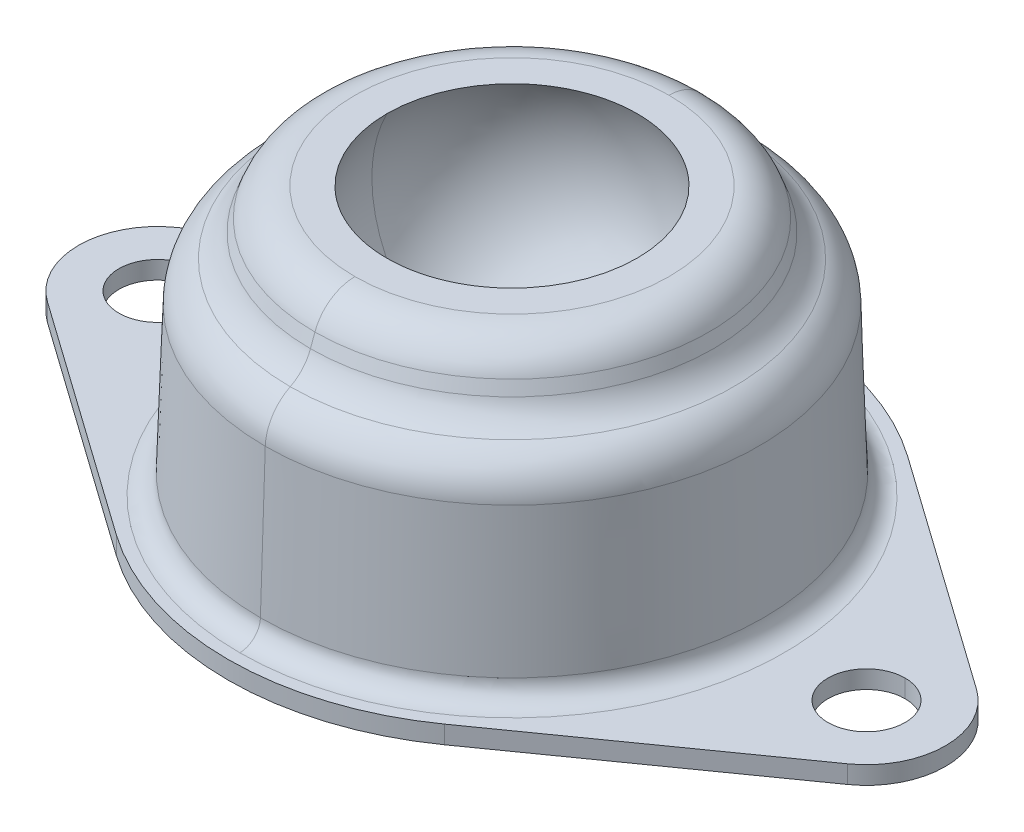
ISO-10303-21;
HEADER;
FILE_DESCRIPTION(('STEP AP214'),'2;1');
FILE_NAME('part.step','',(''),(''),'','','');
FILE_SCHEMA(('AUTOMOTIVE_DESIGN { 1 0 10303 214 1 1 1 1 }'));
ENDSEC;
DATA;
#1=APPLICATION_CONTEXT('core data for automotive mechanical design processes');
#2=APPLICATION_PROTOCOL_DEFINITION('international standard','automotive_design',2000,#1);
#3=PRODUCT_CONTEXT('',#1,'mechanical');
#4=PRODUCT('Part','Part','',(#3));
#5=PRODUCT_RELATED_PRODUCT_CATEGORY('part','',(#4));
#6=PRODUCT_DEFINITION_FORMATION('','',#4);
#7=PRODUCT_DEFINITION_CONTEXT('part definition',#1,'design');
#8=PRODUCT_DEFINITION('design','',#6,#7);
#9=PRODUCT_DEFINITION_SHAPE('','',#8);
#10=(LENGTH_UNIT() NAMED_UNIT(*) SI_UNIT(.MILLI.,.METRE.));
#11=(NAMED_UNIT(*) PLANE_ANGLE_UNIT() SI_UNIT($,.RADIAN.));
#12=(NAMED_UNIT(*) SI_UNIT($,.STERADIAN.) SOLID_ANGLE_UNIT());
#13=UNCERTAINTY_MEASURE_WITH_UNIT(LENGTH_MEASURE(1.E-05),#10,'distance_accuracy_value','');
#14=(GEOMETRIC_REPRESENTATION_CONTEXT(3) GLOBAL_UNCERTAINTY_ASSIGNED_CONTEXT((#13)) GLOBAL_UNIT_ASSIGNED_CONTEXT((#10,
#11,#12)) REPRESENTATION_CONTEXT('',''));
#15=CARTESIAN_POINT('',(0.,0.,0.));
#16=DIRECTION('',(0.,0.,1.));
#17=DIRECTION('',(1.,0.,0.));
#18=AXIS2_PLACEMENT_3D('',#15,#16,#17);
#19=CARTESIAN_POINT('',(0.,12.6365,0.));
#20=DIRECTION('',(0.,0.,-1.));
#21=DIRECTION('',(-1.,0.,0.));
#22=AXIS2_PLACEMENT_3D('',#19,#20,#21);
#23=SPHERICAL_SURFACE('',#22,7.9375);
#24=CARTESIAN_POINT('',(0.,12.6365,0.));
#25=DIRECTION('',(0.,0.,-1.));
#26=DIRECTION('',(-1.,0.,0.));
#27=AXIS2_PLACEMENT_3D('',#24,#25,#26);
#28=CIRCLE('',#27,7.9375);
#29=CARTESIAN_POINT('',(7.09001315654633,16.2052,0.));
#30=VERTEX_POINT('',#29);
#31=CARTESIAN_POINT('',(0.,4.699,0.));
#32=VERTEX_POINT('',#31);
#33=EDGE_CURVE('E439',#30,#32,#28,.T.);
#34=ORIENTED_EDGE('',*,*,#33,.F.);
#35=CARTESIAN_POINT('',(0.,16.2052,0.));
#36=DIRECTION('',(0.,-1.,0.));
#37=DIRECTION('',(0.,0.,-1.));
#38=AXIS2_PLACEMENT_3D('',#35,#36,#37);
#39=CIRCLE('',#38,7.09001315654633);
#40=CARTESIAN_POINT('',(-7.09001315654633,16.2052,0.));
#41=VERTEX_POINT('',#40);
#42=EDGE_CURVE('E304',#41,#30,#39,.T.);
#43=ORIENTED_EDGE('',*,*,#42,.F.);
#44=CARTESIAN_POINT('',(0.,12.6365,0.));
#45=DIRECTION('',(0.,0.,1.));
#46=DIRECTION('',(1.,0.,0.));
#47=AXIS2_PLACEMENT_3D('',#44,#45,#46);
#48=CIRCLE('',#47,7.9375);
#49=EDGE_CURVE('E378',#41,#32,#48,.T.);
#50=ORIENTED_EDGE('',*,*,#49,.T.);
#51=EDGE_LOOP('',(#34,#43,#50));
#52=FACE_BOUND('',#51,.T.);
#53=ADVANCED_FACE('F16',(#52),#23,.F.);
#54=CARTESIAN_POINT('',(0.,12.6365,0.));
#55=DIRECTION('',(0.,0.,-1.));
#56=DIRECTION('',(1.,0.,0.));
#57=AXIS2_PLACEMENT_3D('',#54,#55,#56);
#58=SPHERICAL_SURFACE('',#57,10.7061);
#59=CARTESIAN_POINT('',(0.,12.6365,0.));
#60=DIRECTION('',(0.,0.,-1.));
#61=DIRECTION('',(-1.,0.,0.));
#62=AXIS2_PLACEMENT_3D('',#59,#60,#61);
#63=CIRCLE('',#62,10.7061);
#64=CARTESIAN_POINT('',(0.,1.9304,0.));
#65=VERTEX_POINT('',#64);
#66=CARTESIAN_POINT('',(-10.4564121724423,10.3378,0.));
#67=VERTEX_POINT('',#66);
#68=EDGE_CURVE('E343',#65,#67,#63,.T.);
#69=ORIENTED_EDGE('',*,*,#68,.F.);
#70=CARTESIAN_POINT('',(0.,12.6365,0.));
#71=DIRECTION('',(0.,0.,1.));
#72=DIRECTION('',(1.,0.,0.));
#73=AXIS2_PLACEMENT_3D('',#70,#71,#72);
#74=CIRCLE('',#73,10.7061);
#75=CARTESIAN_POINT('',(10.4564121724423,10.3378,0.));
#76=VERTEX_POINT('',#75);
#77=EDGE_CURVE('E659',#65,#76,#74,.T.);
#78=ORIENTED_EDGE('',*,*,#77,.T.);
#79=CARTESIAN_POINT('',(0.,10.3378,0.));
#80=DIRECTION('',(0.,1.,0.));
#81=DIRECTION('',(0.,0.,1.));
#82=AXIS2_PLACEMENT_3D('',#79,#80,#81);
#83=CIRCLE('',#82,10.4564121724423);
#84=EDGE_CURVE('E11',#67,#76,#83,.T.);
#85=ORIENTED_EDGE('',*,*,#84,.F.);
#86=EDGE_LOOP('',(#69,#78,#85));
#87=FACE_BOUND('',#86,.T.);
#88=ADVANCED_FACE('F690',(#87),#58,.T.);
#89=CARTESIAN_POINT('',(0.,10.3378,0.));
#90=DIRECTION('',(0.,1.,0.));
#91=DIRECTION('',(1.,0.,0.));
#92=AXIS2_PLACEMENT_3D('',#89,#90,#91);
#93=PLANE('',#92);
#94=CARTESIAN_POINT('',(0.,10.3378,0.));
#95=DIRECTION('',(0.,1.,0.));
#96=DIRECTION('',(0.,0.,1.));
#97=AXIS2_PLACEMENT_3D('',#94,#95,#96);
#98=CIRCLE('',#97,10.4564121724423);
#99=EDGE_CURVE('E425',#76,#67,#98,.T.);
#100=ORIENTED_EDGE('',*,*,#99,.T.);
#101=ORIENTED_EDGE('',*,*,#84,.T.);
#102=EDGE_LOOP('',(#100,#101));
#103=FACE_BOUND('',#102,.T.);
#104=CARTESIAN_POINT('',(0.,10.3378,0.));
#105=DIRECTION('',(0.,1.,0.));
#106=DIRECTION('',(0.,0.,1.));
#107=AXIS2_PLACEMENT_3D('',#104,#105,#106);
#108=CIRCLE('',#107,12.2809);
#109=CARTESIAN_POINT('',(0.,10.3378,-12.2809));
#110=VERTEX_POINT('',#109);
#111=CARTESIAN_POINT('',(0.,10.3378,12.2809));
#112=VERTEX_POINT('',#111);
#113=EDGE_CURVE('E300',#110,#112,#108,.T.);
#114=ORIENTED_EDGE('',*,*,#113,.F.);
#115=CARTESIAN_POINT('',(0.,10.3378,0.));
#116=DIRECTION('',(0.,1.,0.));
#117=DIRECTION('',(0.,0.,1.));
#118=AXIS2_PLACEMENT_3D('',#115,#116,#117);
#119=CIRCLE('',#118,12.2809);
#120=EDGE_CURVE('E27',#112,#110,#119,.T.);
#121=ORIENTED_EDGE('',*,*,#120,.F.);
#122=EDGE_LOOP('',(#114,#121));
#123=FACE_BOUND('',#122,.T.);
#124=ADVANCED_FACE('F696',(#103,#123),#93,.F.);
#125=CARTESIAN_POINT('',(0.,10.3378,0.));
#126=DIRECTION('',(0.,-1.,0.));
#127=DIRECTION('',(0.,0.,-1.));
#128=AXIS2_PLACEMENT_3D('',#125,#126,#127);
#129=CONICAL_SURFACE('',#128,12.2809,0.033161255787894);
#130=DIRECTION('',(0.,-0.999450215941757,0.0331551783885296));
#131=VECTOR('',#130,1.);
#132=CARTESIAN_POINT('',(0.,10.3378,12.2809));
#133=LINE('',#132,#131);
#134=CARTESIAN_POINT('',(0.,1.09822428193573,12.5874082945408));
#135=VERTEX_POINT('',#134);
#136=EDGE_CURVE('E292',#112,#135,#133,.T.);
#137=ORIENTED_EDGE('',*,*,#136,.F.);
#138=ORIENTED_EDGE('',*,*,#120,.T.);
#139=DIRECTION('',(0.,-0.999450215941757,-0.0331551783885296));
#140=VECTOR('',#139,1.);
#141=CARTESIAN_POINT('',(0.,10.3378,-12.2809));
#142=LINE('',#141,#140);
#143=CARTESIAN_POINT('',(0.,1.09822428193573,-12.5874082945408));
#144=VERTEX_POINT('',#143);
#145=EDGE_CURVE('E283',#110,#144,#142,.T.);
#146=ORIENTED_EDGE('',*,*,#145,.T.);
#147=CARTESIAN_POINT('',(0.,1.09822428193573,0.));
#148=DIRECTION('',(0.,1.,0.));
#149=DIRECTION('',(0.,0.,1.));
#150=AXIS2_PLACEMENT_3D('',#147,#148,#149);
#151=CIRCLE('',#150,12.5874082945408);
#152=EDGE_CURVE('E277',#135,#144,#151,.T.);
#153=ORIENTED_EDGE('',*,*,#152,.F.);
#154=EDGE_LOOP('',(#137,#138,#146,#153));
#155=FACE_BOUND('',#154,.T.);
#156=ADVANCED_FACE('F285',(#155),#129,.F.);
#157=CARTESIAN_POINT('',(0.,1.1358847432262,0.));
#158=DIRECTION('',(0.,1.,0.));
#159=DIRECTION('',(0.,0.,1.));
#160=AXIS2_PLACEMENT_3D('',#157,#158,#159);
#161=TOROIDAL_SURFACE('',#160,13.7226685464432,1.1358847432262);
#162=CARTESIAN_POINT('',(0.,1.1358847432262,-13.7226685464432));
#163=DIRECTION('',(1.,0.,0.));
#164=DIRECTION('',(0.,0.,-1.));
#165=AXIS2_PLACEMENT_3D('',#162,#163,#164);
#166=CIRCLE('',#165,1.1358847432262);
#167=CARTESIAN_POINT('',(0.,0.,-13.7226685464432));
#168=VERTEX_POINT('',#167);
#169=EDGE_CURVE('E264',#144,#168,#166,.T.);
#170=ORIENTED_EDGE('',*,*,#169,.F.);
#171=CARTESIAN_POINT('',(0.,1.09822428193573,0.));
#172=DIRECTION('',(0.,1.,0.));
#173=DIRECTION('',(0.,0.,1.));
#174=AXIS2_PLACEMENT_3D('',#171,#172,#173);
#175=CIRCLE('',#174,12.5874082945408);
#176=EDGE_CURVE('E269',#144,#135,#175,.T.);
#177=ORIENTED_EDGE('',*,*,#176,.T.);
#178=CARTESIAN_POINT('',(0.,1.1358847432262,13.7226685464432));
#179=DIRECTION('',(-1.,0.,0.));
#180=DIRECTION('',(0.,0.,1.));
#181=AXIS2_PLACEMENT_3D('',#178,#179,#180);
#182=CIRCLE('',#181,1.1358847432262);
#183=CARTESIAN_POINT('',(0.,0.,13.7226685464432));
#184=VERTEX_POINT('',#183);
#185=EDGE_CURVE('E281',#135,#184,#182,.T.);
#186=ORIENTED_EDGE('',*,*,#185,.T.);
#187=CARTESIAN_POINT('',(0.,0.,0.));
#188=DIRECTION('',(0.,1.,0.));
#189=DIRECTION('',(0.,0.,1.));
#190=AXIS2_PLACEMENT_3D('',#187,#188,#189);
#191=CIRCLE('',#190,13.7226685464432);
#192=EDGE_CURVE('E271',#168,#184,#191,.T.);
#193=ORIENTED_EDGE('',*,*,#192,.F.);
#194=EDGE_LOOP('',(#170,#177,#186,#193));
#195=FACE_BOUND('',#194,.T.);
#196=ADVANCED_FACE('F266',(#195),#161,.T.);
#197=CARTESIAN_POINT('',(0.,2.14781962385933,0.));
#198=DIRECTION('',(0.,-1.,0.));
#199=DIRECTION('',(0.,0.,-1.));
#200=AXIS2_PLACEMENT_3D('',#197,#198,#199);
#201=CONICAL_SURFACE('',#200,14.2494,0.033161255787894);
#202=DIRECTION('',(0.,-0.999450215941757,0.0331551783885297));
#203=VECTOR('',#202,1.);
#204=CARTESIAN_POINT('',(0.,2.14781962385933,14.2494));
#205=LINE('',#204,#203);
#206=CARTESIAN_POINT('',(0.,10.4223601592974,13.9749052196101));
#207=VERTEX_POINT('',#206);
#208=CARTESIAN_POINT('',(0.,2.14781962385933,14.2494));
#209=VERTEX_POINT('',#208);
#210=EDGE_CURVE('E315',#207,#209,#205,.T.);
#211=ORIENTED_EDGE('',*,*,#210,.F.);
#212=CARTESIAN_POINT('',(0.,10.4223601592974,0.));
#213=DIRECTION('',(0.,1.,0.));
#214=DIRECTION('',(0.,0.,1.));
#215=AXIS2_PLACEMENT_3D('',#212,#213,#214);
#216=CIRCLE('',#215,13.9749052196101);
#217=CARTESIAN_POINT('',(0.,10.4223601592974,-13.9749052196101));
#218=VERTEX_POINT('',#217);
#219=EDGE_CURVE('E393',#218,#207,#216,.T.);
#220=ORIENTED_EDGE('',*,*,#219,.F.);
#221=DIRECTION('',(0.,-0.999450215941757,-0.0331551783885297));
#222=VECTOR('',#221,1.);
#223=CARTESIAN_POINT('',(0.,2.14781962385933,-14.2494));
#224=LINE('',#223,#222);
#225=CARTESIAN_POINT('',(0.,2.14781962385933,-14.2494));
#226=VERTEX_POINT('',#225);
#227=EDGE_CURVE('E314',#218,#226,#224,.T.);
#228=ORIENTED_EDGE('',*,*,#227,.T.);
#229=CARTESIAN_POINT('',(0.,2.14781962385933,0.));
#230=DIRECTION('',(0.,1.,0.));
#231=DIRECTION('',(0.,0.,1.));
#232=AXIS2_PLACEMENT_3D('',#229,#230,#231);
#233=CIRCLE('',#232,14.2494);
#234=EDGE_CURVE('E487',#226,#209,#233,.T.);
#235=ORIENTED_EDGE('',*,*,#234,.T.);
#236=EDGE_LOOP('',(#211,#220,#228,#235));
#237=FACE_BOUND('',#236,.T.);
#238=ADVANCED_FACE('F597',(#237),#201,.T.);
#239=CARTESIAN_POINT('',(0.,10.3369326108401,0.));
#240=DIRECTION('',(0.,1.,0.));
#241=DIRECTION('',(0.,0.,1.));
#242=AXIS2_PLACEMENT_3D('',#239,#240,#241);
#243=TOROIDAL_SURFACE('',#242,11.3997243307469,2.57659746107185);
#244=CARTESIAN_POINT('',(0.,10.3369326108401,-11.3997243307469));
#245=DIRECTION('',(1.,0.,0.));
#246=DIRECTION('',(0.,0.,-1.));
#247=AXIS2_PLACEMENT_3D('',#244,#245,#246);
#248=CIRCLE('',#247,2.57659746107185);
#249=CARTESIAN_POINT('',(0.,12.6365,-12.5619826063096));
#250=VERTEX_POINT('',#249);
#251=EDGE_CURVE('E450',#218,#250,#248,.T.);
#252=ORIENTED_EDGE('',*,*,#251,.F.);
#253=ORIENTED_EDGE('',*,*,#219,.T.);
#254=CARTESIAN_POINT('',(0.,10.3369326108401,11.3997243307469));
#255=DIRECTION('',(-1.,0.,0.));
#256=DIRECTION('',(0.,0.,1.));
#257=AXIS2_PLACEMENT_3D('',#254,#255,#256);
#258=CIRCLE('',#257,2.57659746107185);
#259=CARTESIAN_POINT('',(0.,12.6365,12.5619826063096));
#260=VERTEX_POINT('',#259);
#261=EDGE_CURVE('E320',#207,#260,#258,.T.);
#262=ORIENTED_EDGE('',*,*,#261,.T.);
#263=CARTESIAN_POINT('',(0.,12.6365,0.));
#264=DIRECTION('',(0.,1.,0.));
#265=DIRECTION('',(0.,0.,1.));
#266=AXIS2_PLACEMENT_3D('',#263,#264,#265);
#267=CIRCLE('',#266,12.5619826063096);
#268=EDGE_CURVE('E431',#250,#260,#267,.T.);
#269=ORIENTED_EDGE('',*,*,#268,.F.);
#270=EDGE_LOOP('',(#252,#253,#262,#269));
#271=FACE_BOUND('',#270,.T.);
#272=ADVANCED_FACE('F596',(#271),#243,.T.);
#273=CARTESIAN_POINT('',(0.,14.7309938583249,0.));
#274=DIRECTION('',(0.,1.,0.));
#275=DIRECTION('',(0.,0.,1.));
#276=AXIS2_PLACEMENT_3D('',#273,#274,#275);
#277=TOROIDAL_SURFACE('',#276,13.6205916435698,2.34681861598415);
#278=CARTESIAN_POINT('',(0.,14.7309938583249,-13.6205916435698));
#279=DIRECTION('',(1.,0.,0.));
#280=DIRECTION('',(0.,0.,-1.));
#281=AXIS2_PLACEMENT_3D('',#278,#279,#280);
#282=CIRCLE('',#281,2.34681861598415);
#283=CARTESIAN_POINT('',(0.,13.9273469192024,-11.4156632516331));
#284=VERTEX_POINT('',#283);
#285=EDGE_CURVE('E319',#284,#250,#282,.T.);
#286=ORIENTED_EDGE('',*,*,#285,.F.);
#287=CARTESIAN_POINT('',(0.,13.9273469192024,0.));
#288=DIRECTION('',(0.,1.,0.));
#289=DIRECTION('',(0.,0.,1.));
#290=AXIS2_PLACEMENT_3D('',#287,#288,#289);
#291=CIRCLE('',#290,11.4156632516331);
#292=CARTESIAN_POINT('',(0.,13.9273469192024,11.4156632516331));
#293=VERTEX_POINT('',#292);
#294=EDGE_CURVE('E394',#293,#284,#291,.T.);
#295=ORIENTED_EDGE('',*,*,#294,.F.);
#296=CARTESIAN_POINT('',(0.,14.7309938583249,13.6205916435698));
#297=DIRECTION('',(-1.,0.,0.));
#298=DIRECTION('',(0.,0.,1.));
#299=AXIS2_PLACEMENT_3D('',#296,#297,#298);
#300=CIRCLE('',#299,2.34681861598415);
#301=EDGE_CURVE('E435',#293,#260,#300,.T.);
#302=ORIENTED_EDGE('',*,*,#301,.T.);
#303=CARTESIAN_POINT('',(0.,12.6365,0.));
#304=DIRECTION('',(0.,1.,0.));
#305=DIRECTION('',(0.,0.,1.));
#306=AXIS2_PLACEMENT_3D('',#303,#304,#305);
#307=CIRCLE('',#306,12.5619826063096);
#308=EDGE_CURVE('E446',#260,#250,#307,.T.);
#309=ORIENTED_EDGE('',*,*,#308,.T.);
#310=EDGE_LOOP('',(#286,#295,#302,#309));
#311=FACE_BOUND('',#310,.T.);
#312=ADVANCED_FACE('F591',(#311),#277,.F.);
#313=CARTESIAN_POINT('',(0.,13.9273469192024,0.));
#314=DIRECTION('',(0.,-1.,0.));
#315=DIRECTION('',(0.,0.,-1.));
#316=AXIS2_PLACEMENT_3D('',#313,#314,#315);
#317=CONICAL_SURFACE('',#316,11.4156632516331,0.349513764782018);
#318=DIRECTION('',(0.,-0.939539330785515,0.342441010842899));
#319=VECTOR('',#318,1.);
#320=CARTESIAN_POINT('',(0.,13.9273469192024,11.4156632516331));
#321=LINE('',#320,#319);
#322=CARTESIAN_POINT('',(0.,14.6188529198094,11.1636248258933));
#323=VERTEX_POINT('',#322);
#324=EDGE_CURVE('E399',#323,#293,#321,.T.);
#325=ORIENTED_EDGE('',*,*,#324,.F.);
#326=CARTESIAN_POINT('',(0.,14.6188529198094,0.));
#327=DIRECTION('',(0.,1.,0.));
#328=DIRECTION('',(0.,0.,1.));
#329=AXIS2_PLACEMENT_3D('',#326,#327,#328);
#330=CIRCLE('',#329,11.1636248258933);
#331=CARTESIAN_POINT('',(0.,14.6188529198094,-11.1636248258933));
#332=VERTEX_POINT('',#331);
#333=EDGE_CURVE('E390',#332,#323,#330,.T.);
#334=ORIENTED_EDGE('',*,*,#333,.F.);
#335=DIRECTION('',(0.,-0.939539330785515,-0.342441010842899));
#336=VECTOR('',#335,1.);
#337=CARTESIAN_POINT('',(0.,13.9273469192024,-11.4156632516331));
#338=LINE('',#337,#336);
#339=EDGE_CURVE('E398',#332,#284,#338,.T.);
#340=ORIENTED_EDGE('',*,*,#339,.T.);
#341=CARTESIAN_POINT('',(0.,13.9273469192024,0.));
#342=DIRECTION('',(0.,1.,0.));
#343=DIRECTION('',(0.,0.,1.));
#344=AXIS2_PLACEMENT_3D('',#341,#342,#343);
#345=CIRCLE('',#344,11.4156632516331);
#346=EDGE_CURVE('E316',#284,#293,#345,.T.);
#347=ORIENTED_EDGE('',*,*,#346,.T.);
#348=EDGE_LOOP('',(#325,#334,#340,#347));
#349=FACE_BOUND('',#348,.T.);
#350=ADVANCED_FACE('F584',(#349),#317,.T.);
#351=CARTESIAN_POINT('',(0.,13.7927212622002,0.));
#352=DIRECTION('',(0.,1.,0.));
#353=DIRECTION('',(0.,0.,1.));
#354=AXIS2_PLACEMENT_3D('',#351,#352,#353);
#355=TOROIDAL_SURFACE('',#354,8.89700616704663,2.41247873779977);
#356=CARTESIAN_POINT('',(0.,13.7927212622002,-8.89700616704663));
#357=DIRECTION('',(1.,0.,0.));
#358=DIRECTION('',(0.,0.,-1.));
#359=AXIS2_PLACEMENT_3D('',#356,#357,#358);
#360=CIRCLE('',#359,2.41247873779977);
#361=CARTESIAN_POINT('',(0.,16.2052,-8.89700616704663));
#362=VERTEX_POINT('',#361);
#363=EDGE_CURVE('E476',#332,#362,#360,.T.);
#364=ORIENTED_EDGE('',*,*,#363,.F.);
#365=ORIENTED_EDGE('',*,*,#333,.T.);
#366=CARTESIAN_POINT('',(0.,13.7927212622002,8.89700616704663));
#367=DIRECTION('',(-1.,0.,0.));
#368=DIRECTION('',(0.,0.,1.));
#369=AXIS2_PLACEMENT_3D('',#366,#367,#368);
#370=CIRCLE('',#369,2.41247873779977);
#371=CARTESIAN_POINT('',(0.,16.2052,8.89700616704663));
#372=VERTEX_POINT('',#371);
#373=EDGE_CURVE('E491',#323,#372,#370,.T.);
#374=ORIENTED_EDGE('',*,*,#373,.T.);
#375=CARTESIAN_POINT('',(0.,16.2052,0.));
#376=DIRECTION('',(0.,1.,0.));
#377=DIRECTION('',(0.,0.,1.));
#378=AXIS2_PLACEMENT_3D('',#375,#376,#377);
#379=CIRCLE('',#378,8.89700616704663);
#380=EDGE_CURVE('E414',#362,#372,#379,.T.);
#381=ORIENTED_EDGE('',*,*,#380,.F.);
#382=EDGE_LOOP('',(#364,#365,#374,#381));
#383=FACE_BOUND('',#382,.T.);
#384=ADVANCED_FACE('F576',(#383),#355,.T.);
#385=CARTESIAN_POINT('',(8.89700616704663,16.2052,0.));
#386=DIRECTION('',(0.,-1.,0.));
#387=DIRECTION('',(0.,0.,-1.));
#388=AXIS2_PLACEMENT_3D('',#385,#386,#387);
#389=PLANE('',#388);
#390=ORIENTED_EDGE('',*,*,#42,.T.);
#391=CARTESIAN_POINT('',(0.,16.2052,0.));
#392=DIRECTION('',(0.,-1.,0.));
#393=DIRECTION('',(0.,0.,-1.));
#394=AXIS2_PLACEMENT_3D('',#391,#392,#393);
#395=CIRCLE('',#394,7.09001315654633);
#396=EDGE_CURVE('E20',#30,#41,#395,.T.);
#397=ORIENTED_EDGE('',*,*,#396,.T.);
#398=EDGE_LOOP('',(#390,#397));
#399=FACE_BOUND('',#398,.T.);
#400=CARTESIAN_POINT('',(0.,16.2052,0.));
#401=DIRECTION('',(0.,1.,0.));
#402=DIRECTION('',(0.,0.,1.));
#403=AXIS2_PLACEMENT_3D('',#400,#401,#402);
#404=CIRCLE('',#403,8.89700616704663);
#405=EDGE_CURVE('E495',#372,#362,#404,.T.);
#406=ORIENTED_EDGE('',*,*,#405,.T.);
#407=ORIENTED_EDGE('',*,*,#380,.T.);
#408=EDGE_LOOP('',(#406,#407));
#409=FACE_BOUND('',#408,.T.);
#410=ADVANCED_FACE('F918',(#399,#409),#389,.F.);
#411=CARTESIAN_POINT('',(0.,2.18663214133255,0.));
#412=DIRECTION('',(0.,1.,0.));
#413=DIRECTION('',(0.,0.,1.));
#414=AXIS2_PLACEMENT_3D('',#411,#412,#413);
#415=TOROIDAL_SURFACE('',#414,15.4193885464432,1.17063214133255);
#416=CARTESIAN_POINT('',(0.,2.18663214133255,-15.4193885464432));
#417=DIRECTION('',(1.,0.,0.));
#418=DIRECTION('',(0.,0.,-1.));
#419=AXIS2_PLACEMENT_3D('',#416,#417,#418);
#420=CIRCLE('',#419,1.17063214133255);
#421=CARTESIAN_POINT('',(0.,1.016,-15.4193885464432));
#422=VERTEX_POINT('',#421);
#423=EDGE_CURVE('E459',#226,#422,#420,.T.);
#424=ORIENTED_EDGE('',*,*,#423,.F.);
#425=CARTESIAN_POINT('',(0.,2.14781962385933,0.));
#426=DIRECTION('',(0.,1.,0.));
#427=DIRECTION('',(0.,0.,1.));
#428=AXIS2_PLACEMENT_3D('',#425,#426,#427);
#429=CIRCLE('',#428,14.2494);
#430=EDGE_CURVE('E310',#209,#226,#429,.T.);
#431=ORIENTED_EDGE('',*,*,#430,.F.);
#432=CARTESIAN_POINT('',(0.,2.18663214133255,15.4193885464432));
#433=DIRECTION('',(-1.,0.,0.));
#434=DIRECTION('',(0.,0.,1.));
#435=AXIS2_PLACEMENT_3D('',#432,#433,#434);
#436=CIRCLE('',#435,1.17063214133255);
#437=CARTESIAN_POINT('',(0.,1.016,15.4193885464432));
#438=VERTEX_POINT('',#437);
#439=EDGE_CURVE('E458',#209,#438,#436,.T.);
#440=ORIENTED_EDGE('',*,*,#439,.T.);
#441=CARTESIAN_POINT('',(0.,1.016,0.));
#442=DIRECTION('',(0.,1.,0.));
#443=DIRECTION('',(0.,0.,1.));
#444=AXIS2_PLACEMENT_3D('',#441,#442,#443);
#445=CIRCLE('',#444,15.4193885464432);
#446=EDGE_CURVE('E388',#438,#422,#445,.T.);
#447=ORIENTED_EDGE('',*,*,#446,.T.);
#448=EDGE_LOOP('',(#424,#431,#440,#447));
#449=FACE_BOUND('',#448,.T.);
#450=ADVANCED_FACE('F18',(#449),#415,.F.);
#451=CARTESIAN_POINT('',(-20.0787,0.,0.));
#452=DIRECTION('',(0.,1.,0.));
#453=DIRECTION('',(0.,0.,1.));
#454=AXIS2_PLACEMENT_3D('',#451,#452,#453);
#455=CYLINDRICAL_SURFACE('',#454,2.1844);
#456=DIRECTION('',(0.,1.,0.));
#457=VECTOR('',#456,1.);
#458=CARTESIAN_POINT('',(-20.0787,0.,-2.1844));
#459=LINE('',#458,#457);
#460=CARTESIAN_POINT('',(-20.0787,0.,-2.1844));
#461=VERTEX_POINT('',#460);
#462=CARTESIAN_POINT('',(-20.0787,1.016,-2.1844));
#463=VERTEX_POINT('',#462);
#464=EDGE_CURVE('E374',#461,#463,#459,.T.);
#465=ORIENTED_EDGE('',*,*,#464,.F.);
#466=CARTESIAN_POINT('',(-20.0787,0.,0.));
#467=DIRECTION('',(0.,1.,0.));
#468=DIRECTION('',(0.,0.,-1.));
#469=AXIS2_PLACEMENT_3D('',#466,#467,#468);
#470=CIRCLE('',#469,2.1844);
#471=CARTESIAN_POINT('',(-20.0787,0.,2.1844));
#472=VERTEX_POINT('',#471);
#473=EDGE_CURVE('E347',#472,#461,#470,.T.);
#474=ORIENTED_EDGE('',*,*,#473,.F.);
#475=DIRECTION('',(0.,1.,0.));
#476=VECTOR('',#475,1.);
#477=CARTESIAN_POINT('',(-20.0787,0.,2.1844));
#478=LINE('',#477,#476);
#479=CARTESIAN_POINT('',(-20.0787,1.016,2.1844));
#480=VERTEX_POINT('',#479);
#481=EDGE_CURVE('E353',#472,#480,#478,.T.);
#482=ORIENTED_EDGE('',*,*,#481,.T.);
#483=CARTESIAN_POINT('',(-20.0787,1.016,0.));
#484=DIRECTION('',(0.,1.,0.));
#485=DIRECTION('',(0.,0.,-1.));
#486=AXIS2_PLACEMENT_3D('',#483,#484,#485);
#487=CIRCLE('',#486,2.1844);
#488=EDGE_CURVE('E430',#480,#463,#487,.T.);
#489=ORIENTED_EDGE('',*,*,#488,.T.);
#490=EDGE_LOOP('',(#465,#474,#482,#489));
#491=FACE_BOUND('',#490,.T.);
#492=ADVANCED_FACE('F718',(#491),#455,.F.);
#493=CARTESIAN_POINT('',(20.0787,0.,0.));
#494=DIRECTION('',(0.,1.,0.));
#495=DIRECTION('',(0.,0.,1.));
#496=AXIS2_PLACEMENT_3D('',#493,#494,#495);
#497=CYLINDRICAL_SURFACE('',#496,2.1844);
#498=DIRECTION('',(0.,1.,0.));
#499=VECTOR('',#498,1.);
#500=CARTESIAN_POINT('',(20.0787,0.,-2.1844));
#501=LINE('',#500,#499);
#502=CARTESIAN_POINT('',(20.0787,0.,-2.1844));
#503=VERTEX_POINT('',#502);
#504=CARTESIAN_POINT('',(20.0787,1.016,-2.1844));
#505=VERTEX_POINT('',#504);
#506=EDGE_CURVE('E352',#503,#505,#501,.T.);
#507=ORIENTED_EDGE('',*,*,#506,.F.);
#508=CARTESIAN_POINT('',(20.0787,0.,0.));
#509=DIRECTION('',(0.,1.,0.));
#510=DIRECTION('',(0.,0.,1.));
#511=AXIS2_PLACEMENT_3D('',#508,#509,#510);
#512=CIRCLE('',#511,2.1844);
#513=CARTESIAN_POINT('',(20.0787,0.,2.1844));
#514=VERTEX_POINT('',#513);
#515=EDGE_CURVE('E412',#514,#503,#512,.T.);
#516=ORIENTED_EDGE('',*,*,#515,.F.);
#517=DIRECTION('',(0.,1.,0.));
#518=VECTOR('',#517,1.);
#519=CARTESIAN_POINT('',(20.0787,0.,2.1844));
#520=LINE('',#519,#518);
#521=CARTESIAN_POINT('',(20.0787,1.016,2.1844));
#522=VERTEX_POINT('',#521);
#523=EDGE_CURVE('E424',#514,#522,#520,.T.);
#524=ORIENTED_EDGE('',*,*,#523,.T.);
#525=CARTESIAN_POINT('',(20.0787,1.016,0.));
#526=DIRECTION('',(0.,1.,0.));
#527=DIRECTION('',(0.,0.,1.));
#528=AXIS2_PLACEMENT_3D('',#525,#526,#527);
#529=CIRCLE('',#528,2.1844);
#530=EDGE_CURVE('E348',#522,#505,#529,.T.);
#531=ORIENTED_EDGE('',*,*,#530,.T.);
#532=EDGE_LOOP('',(#507,#516,#524,#531));
#533=FACE_BOUND('',#532,.T.);
#534=ADVANCED_FACE('F716',(#533),#497,.F.);
#535=CARTESIAN_POINT('',(-20.0787,0.,0.));
#536=DIRECTION('',(0.,1.,0.));
#537=DIRECTION('',(1.,0.,0.));
#538=AXIS2_PLACEMENT_3D('',#535,#536,#537);
#539=PLANE('',#538);
#540=ORIENTED_EDGE('',*,*,#515,.T.);
#541=CARTESIAN_POINT('',(20.0787,0.,0.));
#542=DIRECTION('',(0.,1.,0.));
#543=DIRECTION('',(0.,0.,1.));
#544=AXIS2_PLACEMENT_3D('',#541,#542,#543);
#545=CIRCLE('',#544,2.1844);
#546=EDGE_CURVE('E349',#503,#514,#545,.T.);
#547=ORIENTED_EDGE('',*,*,#546,.T.);
#548=EDGE_LOOP('',(#540,#547));
#549=FACE_BOUND('',#548,.T.);
#550=ORIENTED_EDGE('',*,*,#473,.T.);
#551=CARTESIAN_POINT('',(-20.0787,0.,0.));
#552=DIRECTION('',(0.,1.,0.));
#553=DIRECTION('',(0.,0.,-1.));
#554=AXIS2_PLACEMENT_3D('',#551,#552,#553);
#555=CIRCLE('',#554,2.1844);
#556=EDGE_CURVE('E629',#461,#472,#555,.T.);
#557=ORIENTED_EDGE('',*,*,#556,.T.);
#558=EDGE_LOOP('',(#550,#557));
#559=FACE_BOUND('',#558,.T.);
#560=CARTESIAN_POINT('',(0.,0.,0.));
#561=DIRECTION('',(0.,1.,0.));
#562=DIRECTION('',(0.,0.,1.));
#563=AXIS2_PLACEMENT_3D('',#560,#561,#562);
#564=CIRCLE('',#563,13.7226685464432);
#565=EDGE_CURVE('E276',#184,#168,#564,.T.);
#566=ORIENTED_EDGE('',*,*,#565,.T.);
#567=ORIENTED_EDGE('',*,*,#192,.T.);
#568=EDGE_LOOP('',(#566,#567));
#569=FACE_BOUND('',#568,.T.);
#570=CARTESIAN_POINT('',(-20.0787,0.,0.));
#571=DIRECTION('',(0.,1.,0.));
#572=DIRECTION('',(0.,0.,1.));
#573=AXIS2_PLACEMENT_3D('',#570,#571,#572);
#574=CIRCLE('',#573,4.4704);
#575=CARTESIAN_POINT('',(-22.6631058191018,0.,-3.64764618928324));
#576=VERTEX_POINT('',#575);
#577=CARTESIAN_POINT('',(-22.6631058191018,0.,3.64764618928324));
#578=VERTEX_POINT('',#577);
#579=EDGE_CURVE('E400',#576,#578,#574,.T.);
#580=ORIENTED_EDGE('',*,*,#579,.F.);
#581=DIRECTION('',(-0.815955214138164,0.,0.578115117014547));
#582=VECTOR('',#581,1.);
#583=CARTESIAN_POINT('',(-22.6631058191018,0.,-3.64764618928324));
#584=LINE('',#583,#582);
#585=CARTESIAN_POINT('',(-9.29505047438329,0.,-13.1190911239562));
#586=VERTEX_POINT('',#585);
#587=EDGE_CURVE('E389',#586,#576,#584,.T.);
#588=ORIENTED_EDGE('',*,*,#587,.F.);
#589=CARTESIAN_POINT('',(0.,0.,0.));
#590=DIRECTION('',(0.,1.,0.));
#591=DIRECTION('',(0.,0.,1.));
#592=AXIS2_PLACEMENT_3D('',#589,#590,#591);
#593=CIRCLE('',#592,16.0782);
#594=CARTESIAN_POINT('',(0.,0.,-16.0782));
#595=VERTEX_POINT('',#594);
#596=EDGE_CURVE('E380',#595,#586,#593,.T.);
#597=ORIENTED_EDGE('',*,*,#596,.F.);
#598=CARTESIAN_POINT('',(0.,0.,0.));
#599=DIRECTION('',(0.,1.,0.));
#600=DIRECTION('',(0.,0.,1.));
#601=AXIS2_PLACEMENT_3D('',#598,#599,#600);
#602=CIRCLE('',#601,16.0782);
#603=CARTESIAN_POINT('',(9.29505047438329,0.,-13.1190911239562));
#604=VERTEX_POINT('',#603);
#605=EDGE_CURVE('E501',#604,#595,#602,.T.);
#606=ORIENTED_EDGE('',*,*,#605,.F.);
#607=DIRECTION('',(-0.815955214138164,0.,-0.578115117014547));
#608=VECTOR('',#607,1.);
#609=CARTESIAN_POINT('',(22.6631058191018,0.,-3.64764618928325));
#610=LINE('',#609,#608);
#611=CARTESIAN_POINT('',(22.6631058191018,0.,-3.64764618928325));
#612=VERTEX_POINT('',#611);
#613=EDGE_CURVE('E470',#612,#604,#610,.T.);
#614=ORIENTED_EDGE('',*,*,#613,.F.);
#615=CARTESIAN_POINT('',(20.0787,0.,0.));
#616=DIRECTION('',(0.,1.,0.));
#617=DIRECTION('',(0.,0.,-1.));
#618=AXIS2_PLACEMENT_3D('',#615,#616,#617);
#619=CIRCLE('',#618,4.4704);
#620=CARTESIAN_POINT('',(22.6631058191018,0.,3.64764618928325));
#621=VERTEX_POINT('',#620);
#622=EDGE_CURVE('E460',#621,#612,#619,.T.);
#623=ORIENTED_EDGE('',*,*,#622,.F.);
#624=DIRECTION('',(0.815955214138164,0.,-0.578115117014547));
#625=VECTOR('',#624,1.);
#626=CARTESIAN_POINT('',(22.6631058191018,0.,3.64764618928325));
#627=LINE('',#626,#625);
#628=CARTESIAN_POINT('',(9.29505047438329,0.,13.1190911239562));
#629=VERTEX_POINT('',#628);
#630=EDGE_CURVE('E322',#629,#621,#627,.T.);
#631=ORIENTED_EDGE('',*,*,#630,.F.);
#632=CARTESIAN_POINT('',(0.,0.,0.));
#633=DIRECTION('',(0.,1.,0.));
#634=DIRECTION('',(0.,0.,1.));
#635=AXIS2_PLACEMENT_3D('',#632,#633,#634);
#636=CIRCLE('',#635,16.0782);
#637=CARTESIAN_POINT('',(-9.29505047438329,0.,13.1190911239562));
#638=VERTEX_POINT('',#637);
#639=EDGE_CURVE('E306',#638,#629,#636,.T.);
#640=ORIENTED_EDGE('',*,*,#639,.F.);
#641=DIRECTION('',(0.815955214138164,0.,0.578115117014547));
#642=VECTOR('',#641,1.);
#643=CARTESIAN_POINT('',(-22.6631058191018,0.,3.64764618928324));
#644=LINE('',#643,#642);
#645=EDGE_CURVE('E179',#578,#638,#644,.T.);
#646=ORIENTED_EDGE('',*,*,#645,.F.);
#647=EDGE_LOOP('',(#580,#588,#597,#606,#614,#623,#631,#640,#646));
#648=FACE_BOUND('',#647,.T.);
#649=ADVANCED_FACE('F608',(#549,#559,#569,#648),#539,.F.);
#650=CARTESIAN_POINT('',(-20.0787,1.016,0.));
#651=DIRECTION('',(0.,1.,0.));
#652=DIRECTION('',(1.,0.,0.));
#653=AXIS2_PLACEMENT_3D('',#650,#651,#652);
#654=PLANE('',#653);
#655=ORIENTED_EDGE('',*,*,#530,.F.);
#656=CARTESIAN_POINT('',(20.0787,1.016,0.));
#657=DIRECTION('',(0.,1.,0.));
#658=DIRECTION('',(0.,0.,1.));
#659=AXIS2_PLACEMENT_3D('',#656,#657,#658);
#660=CIRCLE('',#659,2.1844);
#661=EDGE_CURVE('E360',#505,#522,#660,.T.);
#662=ORIENTED_EDGE('',*,*,#661,.F.);
#663=EDGE_LOOP('',(#655,#662));
#664=FACE_BOUND('',#663,.T.);
#665=ORIENTED_EDGE('',*,*,#488,.F.);
#666=CARTESIAN_POINT('',(-20.0787,1.016,0.));
#667=DIRECTION('',(0.,1.,0.));
#668=DIRECTION('',(0.,0.,-1.));
#669=AXIS2_PLACEMENT_3D('',#666,#667,#668);
#670=CIRCLE('',#669,2.1844);
#671=EDGE_CURVE('E364',#463,#480,#670,.T.);
#672=ORIENTED_EDGE('',*,*,#671,.F.);
#673=EDGE_LOOP('',(#665,#672));
#674=FACE_BOUND('',#673,.T.);
#675=ORIENTED_EDGE('',*,*,#446,.F.);
#676=CARTESIAN_POINT('',(0.,1.016,0.));
#677=DIRECTION('',(0.,1.,0.));
#678=DIRECTION('',(0.,0.,1.));
#679=AXIS2_PLACEMENT_3D('',#676,#677,#678);
#680=CIRCLE('',#679,15.4193885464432);
#681=EDGE_CURVE('E454',#422,#438,#680,.T.);
#682=ORIENTED_EDGE('',*,*,#681,.F.);
#683=EDGE_LOOP('',(#675,#682));
#684=FACE_BOUND('',#683,.T.);
#685=CARTESIAN_POINT('',(-20.0787,1.016,0.));
#686=DIRECTION('',(0.,1.,0.));
#687=DIRECTION('',(0.,0.,1.));
#688=AXIS2_PLACEMENT_3D('',#685,#686,#687);
#689=CIRCLE('',#688,4.4704);
#690=CARTESIAN_POINT('',(-22.6631058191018,1.016,-3.64764618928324));
#691=VERTEX_POINT('',#690);
#692=CARTESIAN_POINT('',(-22.6631058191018,1.016,3.64764618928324));
#693=VERTEX_POINT('',#692);
#694=EDGE_CURVE('E407',#691,#693,#689,.T.);
#695=ORIENTED_EDGE('',*,*,#694,.T.);
#696=DIRECTION('',(0.815955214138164,0.,0.578115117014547));
#697=VECTOR('',#696,1.);
#698=CARTESIAN_POINT('',(-22.6631058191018,1.016,3.64764618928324));
#699=LINE('',#698,#697);
#700=CARTESIAN_POINT('',(-9.29505047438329,1.016,13.1190911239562));
#701=VERTEX_POINT('',#700);
#702=EDGE_CURVE('E163',#693,#701,#699,.T.);
#703=ORIENTED_EDGE('',*,*,#702,.T.);
#704=CARTESIAN_POINT('',(0.,1.016,0.));
#705=DIRECTION('',(0.,1.,0.));
#706=DIRECTION('',(0.,0.,1.));
#707=AXIS2_PLACEMENT_3D('',#704,#705,#706);
#708=CIRCLE('',#707,16.0782);
#709=CARTESIAN_POINT('',(9.29505047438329,1.016,13.1190911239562));
#710=VERTEX_POINT('',#709);
#711=EDGE_CURVE('E326',#701,#710,#708,.T.);
#712=ORIENTED_EDGE('',*,*,#711,.T.);
#713=DIRECTION('',(0.815955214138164,0.,-0.578115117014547));
#714=VECTOR('',#713,1.);
#715=CARTESIAN_POINT('',(22.6631058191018,1.016,3.64764618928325));
#716=LINE('',#715,#714);
#717=CARTESIAN_POINT('',(22.6631058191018,1.016,3.64764618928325));
#718=VERTEX_POINT('',#717);
#719=EDGE_CURVE('E465',#710,#718,#716,.T.);
#720=ORIENTED_EDGE('',*,*,#719,.T.);
#721=CARTESIAN_POINT('',(20.0787,1.016,0.));
#722=DIRECTION('',(0.,1.,0.));
#723=DIRECTION('',(0.,0.,-1.));
#724=AXIS2_PLACEMENT_3D('',#721,#722,#723);
#725=CIRCLE('',#724,4.4704);
#726=CARTESIAN_POINT('',(22.6631058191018,1.016,-3.64764618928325));
#727=VERTEX_POINT('',#726);
#728=EDGE_CURVE('E635',#718,#727,#725,.T.);
#729=ORIENTED_EDGE('',*,*,#728,.T.);
#730=DIRECTION('',(-0.815955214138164,0.,-0.578115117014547));
#731=VECTOR('',#730,1.);
#732=CARTESIAN_POINT('',(22.6631058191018,1.016,-3.64764618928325));
#733=LINE('',#732,#731);
#734=CARTESIAN_POINT('',(9.29505047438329,1.016,-13.1190911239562));
#735=VERTEX_POINT('',#734);
#736=EDGE_CURVE('E469',#727,#735,#733,.T.);
#737=ORIENTED_EDGE('',*,*,#736,.T.);
#738=CARTESIAN_POINT('',(0.,1.016,0.));
#739=DIRECTION('',(0.,1.,0.));
#740=DIRECTION('',(0.,0.,1.));
#741=AXIS2_PLACEMENT_3D('',#738,#739,#740);
#742=CIRCLE('',#741,16.0782);
#743=CARTESIAN_POINT('',(0.,1.016,-16.0782));
#744=VERTEX_POINT('',#743);
#745=EDGE_CURVE('E42',#735,#744,#742,.T.);
#746=ORIENTED_EDGE('',*,*,#745,.T.);
#747=CARTESIAN_POINT('',(0.,1.016,0.));
#748=DIRECTION('',(0.,1.,0.));
#749=DIRECTION('',(0.,0.,1.));
#750=AXIS2_PLACEMENT_3D('',#747,#748,#749);
#751=CIRCLE('',#750,16.0782);
#752=CARTESIAN_POINT('',(-9.29505047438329,1.016,-13.1190911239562));
#753=VERTEX_POINT('',#752);
#754=EDGE_CURVE('E420',#744,#753,#751,.T.);
#755=ORIENTED_EDGE('',*,*,#754,.T.);
#756=DIRECTION('',(-0.815955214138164,0.,0.578115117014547));
#757=VECTOR('',#756,1.);
#758=CARTESIAN_POINT('',(-22.6631058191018,1.016,-3.64764618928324));
#759=LINE('',#758,#757);
#760=EDGE_CURVE('E385',#753,#691,#759,.T.);
#761=ORIENTED_EDGE('',*,*,#760,.T.);
#762=EDGE_LOOP('',(#695,#703,#712,#720,#729,#737,#746,#755,#761));
#763=FACE_BOUND('',#762,.T.);
#764=ADVANCED_FACE('F605',(#664,#674,#684,#763),#654,.T.);
#765=CARTESIAN_POINT('',(-22.6631058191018,1.016,-3.64764618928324));
#766=DIRECTION('',(0.578115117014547,0.,0.815955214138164));
#767=DIRECTION('',(0.,-1.,0.));
#768=AXIS2_PLACEMENT_3D('',#765,#766,#767);
#769=PLANE('',#768);
#770=ORIENTED_EDGE('',*,*,#587,.T.);
#771=DIRECTION('',(0.,-1.,0.));
#772=VECTOR('',#771,1.);
#773=CARTESIAN_POINT('',(-22.6631058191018,1.016,-3.64764618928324));
#774=LINE('',#773,#772);
#775=EDGE_CURVE('E411',#691,#576,#774,.T.);
#776=ORIENTED_EDGE('',*,*,#775,.F.);
#777=ORIENTED_EDGE('',*,*,#760,.F.);
#778=DIRECTION('',(0.,-1.,0.));
#779=VECTOR('',#778,1.);
#780=CARTESIAN_POINT('',(-9.29505047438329,1.016,-13.1190911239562));
#781=LINE('',#780,#779);
#782=EDGE_CURVE('E383',#753,#586,#781,.T.);
#783=ORIENTED_EDGE('',*,*,#782,.T.);
#784=EDGE_LOOP('',(#770,#776,#777,#783));
#785=FACE_BOUND('',#784,.T.);
#786=ADVANCED_FACE('F607',(#785),#769,.F.);
#787=CARTESIAN_POINT('',(0.,1.016,0.));
#788=DIRECTION('',(0.,-1.,0.));
#789=DIRECTION('',(0.,0.,-1.));
#790=AXIS2_PLACEMENT_3D('',#787,#788,#789);
#791=CYLINDRICAL_SURFACE('',#790,16.0782);
#792=DIRECTION('',(0.,-1.,0.));
#793=VECTOR('',#792,1.);
#794=CARTESIAN_POINT('',(0.,1.016,-16.0782));
#795=LINE('',#794,#793);
#796=EDGE_CURVE('E384',#744,#595,#795,.T.);
#797=ORIENTED_EDGE('',*,*,#796,.F.);
#798=ORIENTED_EDGE('',*,*,#745,.F.);
#799=DIRECTION('',(0.,-1.,0.));
#800=VECTOR('',#799,1.);
#801=CARTESIAN_POINT('',(9.29505047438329,1.016,-13.1190911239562));
#802=LINE('',#801,#800);
#803=EDGE_CURVE('E466',#735,#604,#802,.T.);
#804=ORIENTED_EDGE('',*,*,#803,.T.);
#805=ORIENTED_EDGE('',*,*,#605,.T.);
#806=EDGE_LOOP('',(#797,#798,#804,#805));
#807=FACE_BOUND('',#806,.T.);
#808=ADVANCED_FACE('F674',(#807),#791,.T.);
#809=CARTESIAN_POINT('',(22.6631058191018,1.016,-3.64764618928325));
#810=DIRECTION('',(-0.578115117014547,0.,0.815955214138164));
#811=DIRECTION('',(0.,1.,0.));
#812=AXIS2_PLACEMENT_3D('',#809,#810,#811);
#813=PLANE('',#812);
#814=ORIENTED_EDGE('',*,*,#613,.T.);
#815=ORIENTED_EDGE('',*,*,#803,.F.);
#816=ORIENTED_EDGE('',*,*,#736,.F.);
#817=DIRECTION('',(0.,-1.,0.));
#818=VECTOR('',#817,1.);
#819=CARTESIAN_POINT('',(22.6631058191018,1.016,-3.64764618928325));
#820=LINE('',#819,#818);
#821=EDGE_CURVE('E464',#727,#612,#820,.T.);
#822=ORIENTED_EDGE('',*,*,#821,.T.);
#823=EDGE_LOOP('',(#814,#815,#816,#822));
#824=FACE_BOUND('',#823,.T.);
#825=ADVANCED_FACE('F672',(#824),#813,.F.);
#826=CARTESIAN_POINT('',(20.0787,1.016,0.));
#827=DIRECTION('',(0.,-1.,0.));
#828=DIRECTION('',(0.,0.,-1.));
#829=AXIS2_PLACEMENT_3D('',#826,#827,#828);
#830=CYLINDRICAL_SURFACE('',#829,4.4704);
#831=ORIENTED_EDGE('',*,*,#622,.T.);
#832=ORIENTED_EDGE('',*,*,#821,.F.);
#833=ORIENTED_EDGE('',*,*,#728,.F.);
#834=DIRECTION('',(0.,-1.,0.));
#835=VECTOR('',#834,1.);
#836=CARTESIAN_POINT('',(22.6631058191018,1.016,3.64764618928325));
#837=LINE('',#836,#835);
#838=EDGE_CURVE('E325',#718,#621,#837,.T.);
#839=ORIENTED_EDGE('',*,*,#838,.T.);
#840=EDGE_LOOP('',(#831,#832,#833,#839));
#841=FACE_BOUND('',#840,.T.);
#842=ADVANCED_FACE('F683',(#841),#830,.T.);
#843=CARTESIAN_POINT('',(22.6631058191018,1.016,3.64764618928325));
#844=DIRECTION('',(-0.578115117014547,0.,-0.815955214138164));
#845=DIRECTION('',(-0.815955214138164,0.,0.578115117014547));
#846=AXIS2_PLACEMENT_3D('',#843,#844,#845);
#847=PLANE('',#846);
#848=ORIENTED_EDGE('',*,*,#630,.T.);
#849=ORIENTED_EDGE('',*,*,#838,.F.);
#850=ORIENTED_EDGE('',*,*,#719,.F.);
#851=DIRECTION('',(0.,-1.,0.));
#852=VECTOR('',#851,1.);
#853=CARTESIAN_POINT('',(9.29505047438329,1.016,13.1190911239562));
#854=LINE('',#853,#852);
#855=EDGE_CURVE('E309',#710,#629,#854,.T.);
#856=ORIENTED_EDGE('',*,*,#855,.T.);
#857=EDGE_LOOP('',(#848,#849,#850,#856));
#858=FACE_BOUND('',#857,.T.);
#859=ADVANCED_FACE('F712',(#858),#847,.F.);
#860=CARTESIAN_POINT('',(0.,1.016,0.));
#861=DIRECTION('',(0.,-1.,0.));
#862=DIRECTION('',(0.,0.,-1.));
#863=AXIS2_PLACEMENT_3D('',#860,#861,#862);
#864=CYLINDRICAL_SURFACE('',#863,16.0782);
#865=ORIENTED_EDGE('',*,*,#639,.T.);
#866=ORIENTED_EDGE('',*,*,#855,.F.);
#867=ORIENTED_EDGE('',*,*,#711,.F.);
#868=DIRECTION('',(0.,-1.,0.));
#869=VECTOR('',#868,1.);
#870=CARTESIAN_POINT('',(-9.29505047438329,1.016,13.1190911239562));
#871=LINE('',#870,#869);
#872=EDGE_CURVE('E410',#701,#638,#871,.T.);
#873=ORIENTED_EDGE('',*,*,#872,.T.);
#874=EDGE_LOOP('',(#865,#866,#867,#873));
#875=FACE_BOUND('',#874,.T.);
#876=ADVANCED_FACE('F751',(#875),#864,.T.);
#877=CARTESIAN_POINT('',(-22.6631058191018,1.016,3.64764618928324));
#878=DIRECTION('',(0.578115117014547,0.,-0.815955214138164));
#879=DIRECTION('',(0.,-1.,0.));
#880=AXIS2_PLACEMENT_3D('',#877,#878,#879);
#881=PLANE('',#880);
#882=ORIENTED_EDGE('',*,*,#645,.T.);
#883=ORIENTED_EDGE('',*,*,#872,.F.);
#884=ORIENTED_EDGE('',*,*,#702,.F.);
#885=DIRECTION('',(0.,-1.,0.));
#886=VECTOR('',#885,1.);
#887=CARTESIAN_POINT('',(-22.6631058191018,1.016,3.64764618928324));
#888=LINE('',#887,#886);
#889=EDGE_CURVE('E404',#693,#578,#888,.T.);
#890=ORIENTED_EDGE('',*,*,#889,.T.);
#891=EDGE_LOOP('',(#882,#883,#884,#890));
#892=FACE_BOUND('',#891,.T.);
#893=ADVANCED_FACE('F618',(#892),#881,.F.);
#894=CARTESIAN_POINT('',(-20.0787,1.016,0.));
#895=DIRECTION('',(0.,-1.,0.));
#896=DIRECTION('',(0.,0.,-1.));
#897=AXIS2_PLACEMENT_3D('',#894,#895,#896);
#898=CYLINDRICAL_SURFACE('',#897,4.4704);
#899=ORIENTED_EDGE('',*,*,#579,.T.);
#900=ORIENTED_EDGE('',*,*,#889,.F.);
#901=ORIENTED_EDGE('',*,*,#694,.F.);
#902=ORIENTED_EDGE('',*,*,#775,.T.);
#903=EDGE_LOOP('',(#899,#900,#901,#902));
#904=FACE_BOUND('',#903,.T.);
#905=ADVANCED_FACE('F617',(#904),#898,.T.);
#906=CARTESIAN_POINT('',(0.,1.016,0.));
#907=DIRECTION('',(0.,-1.,0.));
#908=DIRECTION('',(0.,0.,-1.));
#909=AXIS2_PLACEMENT_3D('',#906,#907,#908);
#910=CYLINDRICAL_SURFACE('',#909,16.0782);
#911=ORIENTED_EDGE('',*,*,#754,.F.);
#912=ORIENTED_EDGE('',*,*,#796,.T.);
#913=ORIENTED_EDGE('',*,*,#596,.T.);
#914=ORIENTED_EDGE('',*,*,#782,.F.);
#915=EDGE_LOOP('',(#911,#912,#913,#914));
#916=FACE_BOUND('',#915,.T.);
#917=ADVANCED_FACE('F834',(#916),#910,.T.);
#918=CARTESIAN_POINT('',(20.0787,0.,0.));
#919=DIRECTION('',(0.,1.,0.));
#920=DIRECTION('',(0.,0.,1.));
#921=AXIS2_PLACEMENT_3D('',#918,#919,#920);
#922=CYLINDRICAL_SURFACE('',#921,2.1844);
#923=ORIENTED_EDGE('',*,*,#546,.F.);
#924=ORIENTED_EDGE('',*,*,#506,.T.);
#925=ORIENTED_EDGE('',*,*,#661,.T.);
#926=ORIENTED_EDGE('',*,*,#523,.F.);
#927=EDGE_LOOP('',(#923,#924,#925,#926));
#928=FACE_BOUND('',#927,.T.);
#929=ADVANCED_FACE('F829',(#928),#922,.F.);
#930=CARTESIAN_POINT('',(-20.0787,0.,0.));
#931=DIRECTION('',(0.,1.,0.));
#932=DIRECTION('',(0.,0.,1.));
#933=AXIS2_PLACEMENT_3D('',#930,#931,#932);
#934=CYLINDRICAL_SURFACE('',#933,2.1844);
#935=ORIENTED_EDGE('',*,*,#556,.F.);
#936=ORIENTED_EDGE('',*,*,#464,.T.);
#937=ORIENTED_EDGE('',*,*,#671,.T.);
#938=ORIENTED_EDGE('',*,*,#481,.F.);
#939=EDGE_LOOP('',(#935,#936,#937,#938));
#940=FACE_BOUND('',#939,.T.);
#941=ADVANCED_FACE('F704',(#940),#934,.F.);
#942=CARTESIAN_POINT('',(0.,2.18663214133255,0.));
#943=DIRECTION('',(0.,1.,0.));
#944=DIRECTION('',(0.,0.,1.));
#945=AXIS2_PLACEMENT_3D('',#942,#943,#944);
#946=TOROIDAL_SURFACE('',#945,15.4193885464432,1.17063214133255);
#947=ORIENTED_EDGE('',*,*,#234,.F.);
#948=ORIENTED_EDGE('',*,*,#423,.T.);
#949=ORIENTED_EDGE('',*,*,#681,.T.);
#950=ORIENTED_EDGE('',*,*,#439,.F.);
#951=EDGE_LOOP('',(#947,#948,#949,#950));
#952=FACE_BOUND('',#951,.T.);
#953=ADVANCED_FACE('F603',(#952),#946,.F.);
#954=CARTESIAN_POINT('',(0.,13.7927212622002,0.));
#955=DIRECTION('',(0.,1.,0.));
#956=DIRECTION('',(0.,0.,1.));
#957=AXIS2_PLACEMENT_3D('',#954,#955,#956);
#958=TOROIDAL_SURFACE('',#957,8.89700616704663,2.41247873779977);
#959=CARTESIAN_POINT('',(0.,14.6188529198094,0.));
#960=DIRECTION('',(0.,1.,0.));
#961=DIRECTION('',(0.,0.,1.));
#962=AXIS2_PLACEMENT_3D('',#959,#960,#961);
#963=CIRCLE('',#962,11.1636248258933);
#964=EDGE_CURVE('E481',#323,#332,#963,.T.);
#965=ORIENTED_EDGE('',*,*,#964,.T.);
#966=ORIENTED_EDGE('',*,*,#363,.T.);
#967=ORIENTED_EDGE('',*,*,#405,.F.);
#968=ORIENTED_EDGE('',*,*,#373,.F.);
#969=EDGE_LOOP('',(#965,#966,#967,#968));
#970=FACE_BOUND('',#969,.T.);
#971=ADVANCED_FACE('F571',(#970),#958,.T.);
#972=CARTESIAN_POINT('',(0.,13.9273469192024,0.));
#973=DIRECTION('',(0.,-1.,0.));
#974=DIRECTION('',(0.,0.,-1.));
#975=AXIS2_PLACEMENT_3D('',#972,#973,#974);
#976=CONICAL_SURFACE('',#975,11.4156632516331,0.349513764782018);
#977=ORIENTED_EDGE('',*,*,#964,.F.);
#978=ORIENTED_EDGE('',*,*,#324,.T.);
#979=ORIENTED_EDGE('',*,*,#294,.T.);
#980=ORIENTED_EDGE('',*,*,#339,.F.);
#981=EDGE_LOOP('',(#977,#978,#979,#980));
#982=FACE_BOUND('',#981,.T.);
#983=ADVANCED_FACE('F580',(#982),#976,.T.);
#984=CARTESIAN_POINT('',(0.,14.7309938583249,0.));
#985=DIRECTION('',(0.,1.,0.));
#986=DIRECTION('',(0.,0.,1.));
#987=AXIS2_PLACEMENT_3D('',#984,#985,#986);
#988=TOROIDAL_SURFACE('',#987,13.6205916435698,2.34681861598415);
#989=ORIENTED_EDGE('',*,*,#346,.F.);
#990=ORIENTED_EDGE('',*,*,#285,.T.);
#991=ORIENTED_EDGE('',*,*,#268,.T.);
#992=ORIENTED_EDGE('',*,*,#301,.F.);
#993=EDGE_LOOP('',(#989,#990,#991,#992));
#994=FACE_BOUND('',#993,.T.);
#995=ADVANCED_FACE('F588',(#994),#988,.F.);
#996=CARTESIAN_POINT('',(0.,10.3369326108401,0.));
#997=DIRECTION('',(0.,1.,0.));
#998=DIRECTION('',(0.,0.,1.));
#999=AXIS2_PLACEMENT_3D('',#996,#997,#998);
#1000=TOROIDAL_SURFACE('',#999,11.3997243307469,2.57659746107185);
#1001=CARTESIAN_POINT('',(0.,10.4223601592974,0.));
#1002=DIRECTION('',(0.,1.,0.));
#1003=DIRECTION('',(0.,0.,1.));
#1004=AXIS2_PLACEMENT_3D('',#1001,#1002,#1003);
#1005=CIRCLE('',#1004,13.9749052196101);
#1006=EDGE_CURVE('E419',#207,#218,#1005,.T.);
#1007=ORIENTED_EDGE('',*,*,#1006,.T.);
#1008=ORIENTED_EDGE('',*,*,#251,.T.);
#1009=ORIENTED_EDGE('',*,*,#308,.F.);
#1010=ORIENTED_EDGE('',*,*,#261,.F.);
#1011=EDGE_LOOP('',(#1007,#1008,#1009,#1010));
#1012=FACE_BOUND('',#1011,.T.);
#1013=ADVANCED_FACE('F549',(#1012),#1000,.T.);
#1014=CARTESIAN_POINT('',(0.,2.14781962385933,0.));
#1015=DIRECTION('',(0.,-1.,0.));
#1016=DIRECTION('',(0.,0.,-1.));
#1017=AXIS2_PLACEMENT_3D('',#1014,#1015,#1016);
#1018=CONICAL_SURFACE('',#1017,14.2494,0.033161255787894);
#1019=ORIENTED_EDGE('',*,*,#1006,.F.);
#1020=ORIENTED_EDGE('',*,*,#210,.T.);
#1021=ORIENTED_EDGE('',*,*,#430,.T.);
#1022=ORIENTED_EDGE('',*,*,#227,.F.);
#1023=EDGE_LOOP('',(#1019,#1020,#1021,#1022));
#1024=FACE_BOUND('',#1023,.T.);
#1025=ADVANCED_FACE('F555',(#1024),#1018,.T.);
#1026=CARTESIAN_POINT('',(0.,1.1358847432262,0.));
#1027=DIRECTION('',(0.,1.,0.));
#1028=DIRECTION('',(0.,0.,1.));
#1029=AXIS2_PLACEMENT_3D('',#1026,#1027,#1028);
#1030=TOROIDAL_SURFACE('',#1029,13.7226685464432,1.1358847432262);
#1031=ORIENTED_EDGE('',*,*,#152,.T.);
#1032=ORIENTED_EDGE('',*,*,#169,.T.);
#1033=ORIENTED_EDGE('',*,*,#565,.F.);
#1034=ORIENTED_EDGE('',*,*,#185,.F.);
#1035=EDGE_LOOP('',(#1031,#1032,#1033,#1034));
#1036=FACE_BOUND('',#1035,.T.);
#1037=ADVANCED_FACE('F280',(#1036),#1030,.T.);
#1038=CARTESIAN_POINT('',(0.,10.3378,0.));
#1039=DIRECTION('',(0.,-1.,0.));
#1040=DIRECTION('',(0.,0.,-1.));
#1041=AXIS2_PLACEMENT_3D('',#1038,#1039,#1040);
#1042=CONICAL_SURFACE('',#1041,12.2809,0.033161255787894);
#1043=ORIENTED_EDGE('',*,*,#113,.T.);
#1044=ORIENTED_EDGE('',*,*,#136,.T.);
#1045=ORIENTED_EDGE('',*,*,#176,.F.);
#1046=ORIENTED_EDGE('',*,*,#145,.F.);
#1047=EDGE_LOOP('',(#1043,#1044,#1045,#1046));
#1048=FACE_BOUND('',#1047,.T.);
#1049=ADVANCED_FACE('F291',(#1048),#1042,.F.);
#1050=CARTESIAN_POINT('',(0.,12.6365,0.));
#1051=DIRECTION('',(0.,0.,-1.));
#1052=DIRECTION('',(1.,0.,0.));
#1053=AXIS2_PLACEMENT_3D('',#1050,#1051,#1052);
#1054=SPHERICAL_SURFACE('',#1053,10.7061);
#1055=ORIENTED_EDGE('',*,*,#77,.F.);
#1056=ORIENTED_EDGE('',*,*,#68,.T.);
#1057=ORIENTED_EDGE('',*,*,#99,.F.);
#1058=EDGE_LOOP('',(#1055,#1056,#1057));
#1059=FACE_BOUND('',#1058,.T.);
#1060=ADVANCED_FACE('F705',(#1059),#1054,.T.);
#1061=CARTESIAN_POINT('',(0.,12.6365,0.));
#1062=DIRECTION('',(0.,0.,-1.));
#1063=DIRECTION('',(-1.,0.,0.));
#1064=AXIS2_PLACEMENT_3D('',#1061,#1062,#1063);
#1065=SPHERICAL_SURFACE('',#1064,7.9375);
#1066=ORIENTED_EDGE('',*,*,#396,.F.);
#1067=ORIENTED_EDGE('',*,*,#33,.T.);
#1068=ORIENTED_EDGE('',*,*,#49,.F.);
#1069=EDGE_LOOP('',(#1066,#1067,#1068));
#1070=FACE_BOUND('',#1069,.T.);
#1071=ADVANCED_FACE('F708',(#1070),#1065,.F.);
#1072=CLOSED_SHELL('',(#53,#88,#124,#156,#196,#238,#272,#312,#350,#384,#410,#450,#492,#534,#649,
#764,#786,#808,#825,#842,#859,#876,#893,#905,#917,#929,#941,#953,#971,#983,#995,#1013,#1025,
#1037,#1049,#1060,#1071));
#1073=MANIFOLD_SOLID_BREP('B1',#1072);
#1074=ADVANCED_BREP_SHAPE_REPRESENTATION('',(#18,#1073),#14);
#1075=SHAPE_DEFINITION_REPRESENTATION(#9,#1074);
ENDSEC;
END-ISO-10303-21;
